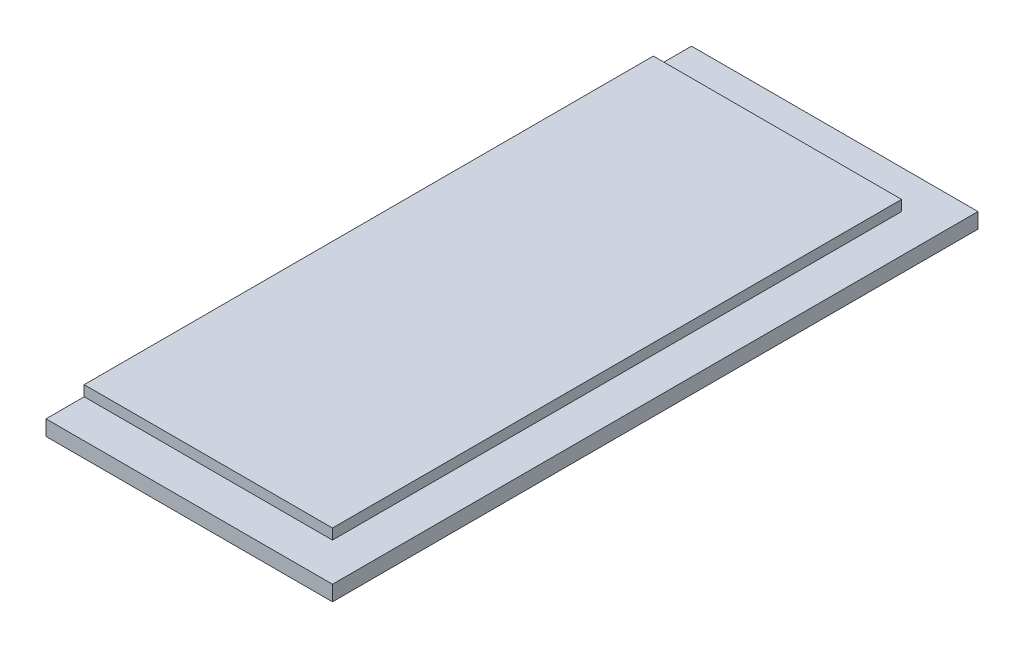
from build123d import *

# Parameters (mm, degrees)
SKETCH1_W           = 30
SKETCH1_H           = 67.6
BOSS_EXTRUDE1_DEPTH = 3.8
CUT_EXTRUDE1_REACH  = 71.348
SKETCH2_W           = 4
SKETCH2_H           = 1.1
CUT_EXTRUDE2_REACH  = 47.353
SKETCH3_W           = 4
SKETCH3_H           = 1.1


with BuildPart() as part:
    # Sketch1 → Boss-Extrude1 (new body)
    with BuildSketch(Plane(origin=(0, 0, 0), x_dir=(1, 0, 0), z_dir=(0, 1, 0))):
        Rectangle(SKETCH1_W, SKETCH1_H)
    extrude(amount=BOSS_EXTRUDE1_DEPTH)

    # Sketch2 → Cut-Extrude1 (cut, up to next)
    with BuildSketch(Plane.XY.offset(33.8), mode=Mode.PRIVATE) as cut_extrude1_sk1:
        with Locations((13, 3.25)):
            Rectangle(SKETCH2_W, SKETCH2_H)
    cut_extrude1_tool1 = extrude(cut_extrude1_sk1.sketch, amount=-CUT_EXTRUDE1_REACH, mode=Mode.PRIVATE) & part.part
    # Sketch2 → Cut-Extrude1 (cut, up to next)
    with BuildSketch(Plane.XY.offset(33.8), mode=Mode.PRIVATE) as cut_extrude1_sk2:
        with Locations((13, 0.55)):
            Rectangle(SKETCH2_W, SKETCH2_H)
    cut_extrude1_tool2 = extrude(cut_extrude1_sk2.sketch, amount=-CUT_EXTRUDE1_REACH, mode=Mode.PRIVATE) & part.part
    add(cut_extrude1_tool1.solids().sort_by_distance((13, 3.25, 33.8))[0], mode=Mode.SUBTRACT)
    add(cut_extrude1_tool2.solids().sort_by_distance((13, 0.55, 33.8))[0], mode=Mode.SUBTRACT)

    # Sketch3 → Cut-Extrude2 (cut, up to next)
    with BuildSketch(Plane.ZY.offset(15), mode=Mode.PRIVATE) as cut_extrude2_sk1:
        with Locations((31.8, 3.25)):
            Rectangle(SKETCH3_W, SKETCH3_H)
    cut_extrude2_tool1 = extrude(cut_extrude2_sk1.sketch, amount=-CUT_EXTRUDE2_REACH, mode=Mode.PRIVATE) & part.part
    # Sketch3 → Cut-Extrude2 (cut, up to next)
    with BuildSketch(Plane.ZY.offset(15), mode=Mode.PRIVATE) as cut_extrude2_sk2:
        with Locations((31.8, 0.55)):
            Rectangle(SKETCH3_W, SKETCH3_H)
    cut_extrude2_tool2 = extrude(cut_extrude2_sk2.sketch, amount=-CUT_EXTRUDE2_REACH, mode=Mode.PRIVATE) & part.part
    # Sketch3 → Cut-Extrude2 (cut, up to next)
    with BuildSketch(Plane.ZY.offset(15), mode=Mode.PRIVATE) as cut_extrude2_sk3:
        with Locations((-31.8, 3.25)):
            Rectangle(SKETCH3_W, SKETCH3_H)
    cut_extrude2_tool3 = extrude(cut_extrude2_sk3.sketch, amount=-CUT_EXTRUDE2_REACH, mode=Mode.PRIVATE) & part.part
    # Sketch3 → Cut-Extrude2 (cut, up to next)
    with BuildSketch(Plane.ZY.offset(15), mode=Mode.PRIVATE) as cut_extrude2_sk4:
        with Locations((-31.8, 0.55)):
            Rectangle(SKETCH3_W, SKETCH3_H)
    cut_extrude2_tool4 = extrude(cut_extrude2_sk4.sketch, amount=-CUT_EXTRUDE2_REACH, mode=Mode.PRIVATE) & part.part
    add(cut_extrude2_tool1.solids().sort_by_distance((-15, 3.25, 31.8))[0], mode=Mode.SUBTRACT)
    add(cut_extrude2_tool2.solids().sort_by_distance((-15, 0.55, 31.8))[0], mode=Mode.SUBTRACT)
    add(cut_extrude2_tool3.solids().sort_by_distance((-15, 3.25, -31.8))[0], mode=Mode.SUBTRACT)
    add(cut_extrude2_tool4.solids().sort_by_distance((-15, 0.55, -31.8))[0], mode=Mode.SUBTRACT)


solid = part.part
